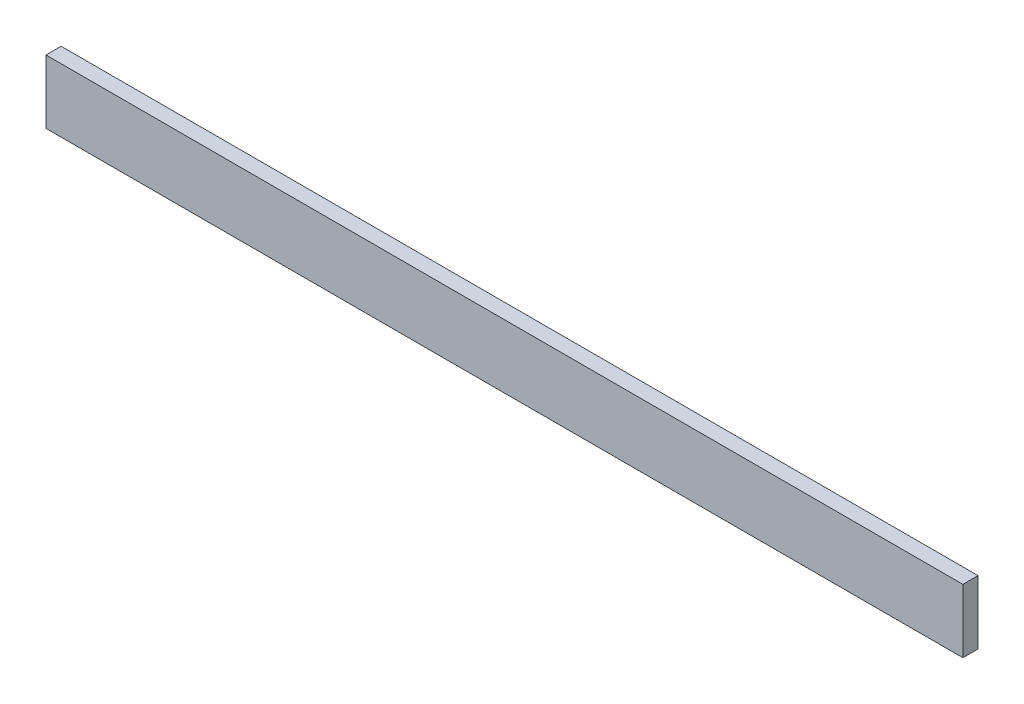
from build123d import *

# Parameters (mm, degrees)
SKETCH1_W           = 1153.80008
SKETCH1_H           = 80
BOSS_EXTRUDE1_DEPTH = 19.05


with BuildPart() as part:
    # Sketch1 → Boss-Extrude1 (new body)
    with BuildSketch(Plane.XY):
        with Locations((498.15228271, -17.842010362)):
            Rectangle(SKETCH1_W, SKETCH1_H)
    extrude(amount=BOSS_EXTRUDE1_DEPTH)


solid = part.part
